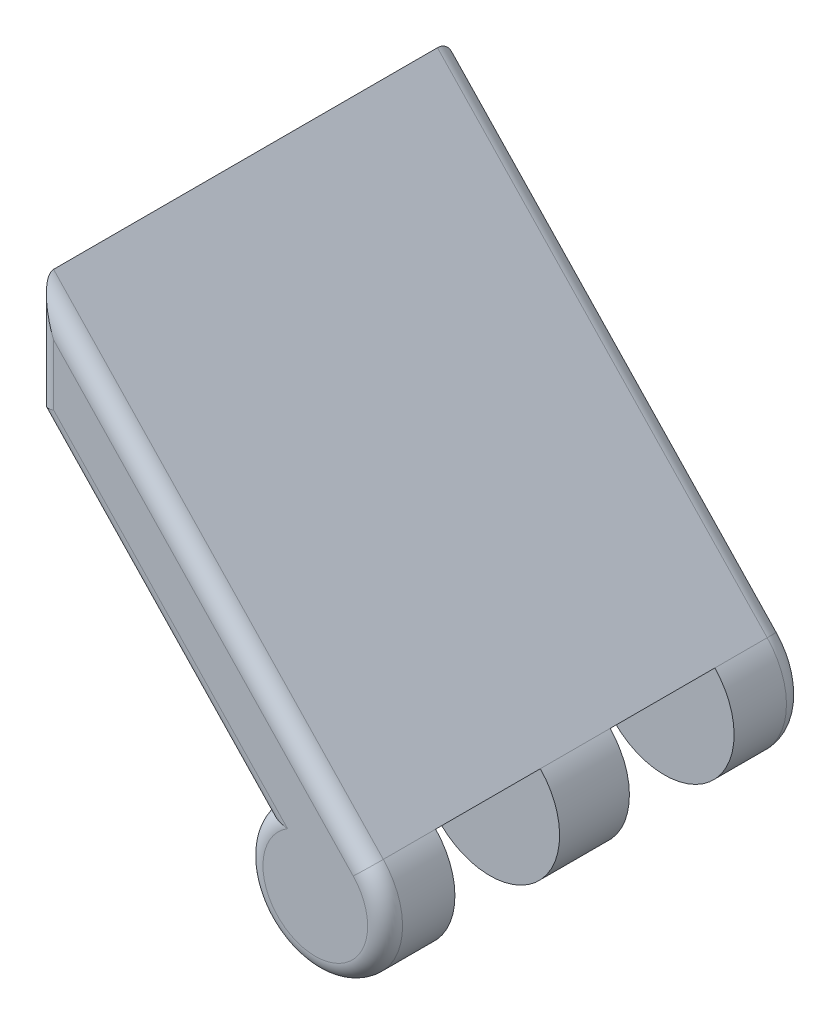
ISO-10303-21;
HEADER;
FILE_DESCRIPTION(('STEP AP214'),'2;1');
FILE_NAME('part.step','',(''),(''),'','','');
FILE_SCHEMA(('AUTOMOTIVE_DESIGN { 1 0 10303 214 1 1 1 1 }'));
ENDSEC;
DATA;
#1=APPLICATION_CONTEXT('core data for automotive mechanical design processes');
#2=APPLICATION_PROTOCOL_DEFINITION('international standard','automotive_design',2000,#1);
#3=PRODUCT_CONTEXT('',#1,'mechanical');
#4=PRODUCT('Part','Part','',(#3));
#5=PRODUCT_RELATED_PRODUCT_CATEGORY('part','',(#4));
#6=PRODUCT_DEFINITION_FORMATION('','',#4);
#7=PRODUCT_DEFINITION_CONTEXT('part definition',#1,'design');
#8=PRODUCT_DEFINITION('design','',#6,#7);
#9=PRODUCT_DEFINITION_SHAPE('','',#8);
#10=(LENGTH_UNIT() NAMED_UNIT(*) SI_UNIT(.MILLI.,.METRE.));
#11=(NAMED_UNIT(*) PLANE_ANGLE_UNIT() SI_UNIT($,.RADIAN.));
#12=(NAMED_UNIT(*) SI_UNIT($,.STERADIAN.) SOLID_ANGLE_UNIT());
#13=UNCERTAINTY_MEASURE_WITH_UNIT(LENGTH_MEASURE(1.E-05),#10,'distance_accuracy_value','');
#14=(GEOMETRIC_REPRESENTATION_CONTEXT(3) GLOBAL_UNCERTAINTY_ASSIGNED_CONTEXT((#13)) GLOBAL_UNIT_ASSIGNED_CONTEXT((#10,
#11,#12)) REPRESENTATION_CONTEXT('',''));
#15=CARTESIAN_POINT('',(0.,0.,0.));
#16=DIRECTION('',(0.,0.,1.));
#17=DIRECTION('',(1.,0.,0.));
#18=AXIS2_PLACEMENT_3D('',#15,#16,#17);
#19=CARTESIAN_POINT('',(98.5993510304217,230.596126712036,15.24));
#20=DIRECTION('',(0.,0.,-1.));
#21=DIRECTION('',(-1.,0.,0.));
#22=AXIS2_PLACEMENT_3D('',#19,#20,#21);
#23=CYLINDRICAL_SURFACE('',#22,5.08);
#24=CARTESIAN_POINT('',(98.5993510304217,230.596126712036,-10.16));
#25=DIRECTION('',(0.,0.,1.));
#26=DIRECTION('',(1.,0.,0.));
#27=AXIS2_PLACEMENT_3D('',#24,#25,#26);
#28=CIRCLE('',#27,5.07999999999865);
#29=CARTESIAN_POINT('',(94.74509960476,233.905378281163,-10.16));
#30=VERTEX_POINT('',#29);
#31=CARTESIAN_POINT('',(102.277439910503,234.10013330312,-10.16));
#32=VERTEX_POINT('',#31);
#33=EDGE_CURVE('E131',#30,#32,#28,.T.);
#34=ORIENTED_EDGE('',*,*,#33,.F.);
#35=DIRECTION('',(0.,0.,-1.));
#36=VECTOR('',#35,1.);
#37=CARTESIAN_POINT('',(94.7450996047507,233.905378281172,15.24));
#38=LINE('',#37,#36);
#39=CARTESIAN_POINT('',(94.7450996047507,233.905378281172,-13.97));
#40=VERTEX_POINT('',#39);
#41=EDGE_CURVE('E151',#30,#40,#38,.T.);
#42=ORIENTED_EDGE('',*,*,#41,.T.);
#43=CARTESIAN_POINT('',(98.5993510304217,230.596126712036,-13.97));
#44=DIRECTION('',(0.,0.,1.));
#45=DIRECTION('',(1.,0.,0.));
#46=AXIS2_PLACEMENT_3D('',#43,#44,#45);
#47=CIRCLE('',#46,5.08);
#48=CARTESIAN_POINT('',(102.277439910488,234.100133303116,-13.97));
#49=VERTEX_POINT('',#48);
#50=EDGE_CURVE('E157',#40,#49,#47,.T.);
#51=ORIENTED_EDGE('',*,*,#50,.T.);
#52=DIRECTION('',(0.,0.,-1.));
#53=VECTOR('',#52,1.);
#54=CARTESIAN_POINT('',(102.277439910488,234.100133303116,15.24));
#55=LINE('',#54,#53);
#56=EDGE_CURVE('E145',#32,#49,#55,.T.);
#57=ORIENTED_EDGE('',*,*,#56,.F.);
#58=EDGE_LOOP('',(#34,#42,#51,#57));
#59=FACE_BOUND('',#58,.T.);
#60=ADVANCED_FACE('F30',(#59),#23,.T.);
#61=CARTESIAN_POINT('',(94.7450996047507,233.905378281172,2.54));
#62=VERTEX_POINT('',#61);
#63=CARTESIAN_POINT('',(94.7450996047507,233.905378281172,-2.53999999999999));
#64=VERTEX_POINT('',#63);
#65=EDGE_CURVE('E141',#62,#64,#38,.T.);
#66=ORIENTED_EDGE('',*,*,#65,.T.);
#67=CARTESIAN_POINT('',(98.5993510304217,230.596126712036,-2.54));
#68=DIRECTION('',(0.,0.,1.));
#69=DIRECTION('',(1.,0.,0.));
#70=AXIS2_PLACEMENT_3D('',#67,#68,#69);
#71=CIRCLE('',#70,5.07999999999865);
#72=CARTESIAN_POINT('',(102.277439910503,234.10013330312,-2.54));
#73=VERTEX_POINT('',#72);
#74=EDGE_CURVE('E129',#64,#73,#71,.T.);
#75=ORIENTED_EDGE('',*,*,#74,.T.);
#76=CARTESIAN_POINT('',(102.277439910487,234.100133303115,2.54));
#77=VERTEX_POINT('',#76);
#78=EDGE_CURVE('E138',#77,#73,#55,.T.);
#79=ORIENTED_EDGE('',*,*,#78,.F.);
#80=CARTESIAN_POINT('',(98.5993510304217,230.596126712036,2.54));
#81=DIRECTION('',(0.,0.,1.));
#82=DIRECTION('',(1.,0.,0.));
#83=AXIS2_PLACEMENT_3D('',#80,#81,#82);
#84=CIRCLE('',#83,5.08);
#85=EDGE_CURVE('E38',#62,#77,#84,.T.);
#86=ORIENTED_EDGE('',*,*,#85,.F.);
#87=EDGE_LOOP('',(#66,#75,#79,#86));
#88=FACE_BOUND('',#87,.T.);
#89=ADVANCED_FACE('F136',(#88),#23,.T.);
#90=CARTESIAN_POINT('',(-44592.4615174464,47149.3150691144,15.24));
#91=DIRECTION('',(0.724033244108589,0.689765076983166,0.));
#92=DIRECTION('',(-0.689765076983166,0.724033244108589,0.));
#93=AXIS2_PLACEMENT_3D('',#90,#91,#92);
#94=PLANE('',#93);
#95=CARTESIAN_POINT('',(102.277439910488,234.100133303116,13.97));
#96=VERTEX_POINT('',#95);
#97=CARTESIAN_POINT('',(102.277439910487,234.100133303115,10.16));
#98=VERTEX_POINT('',#97);
#99=EDGE_CURVE('E147',#96,#98,#55,.T.);
#100=ORIENTED_EDGE('',*,*,#99,.T.);
#101=EDGE_CURVE('E144',#98,#77,#55,.T.);
#102=ORIENTED_EDGE('',*,*,#101,.T.);
#103=ORIENTED_EDGE('',*,*,#78,.T.);
#104=DIRECTION('',(0.,0.,1.));
#105=VECTOR('',#104,1.);
#106=CARTESIAN_POINT('',(102.277439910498,234.100133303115,-10.16));
#107=LINE('',#106,#105);
#108=EDGE_CURVE('E118',#32,#73,#107,.T.);
#109=ORIENTED_EDGE('',*,*,#108,.F.);
#110=ORIENTED_EDGE('',*,*,#56,.T.);
#111=DIRECTION('',(0.689765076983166,-0.724033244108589,0.));
#112=VECTOR('',#111,1.);
#113=CARTESIAN_POINT('',(78.2793510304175,259.290469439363,-13.97));
#114=LINE('',#113,#112);
#115=CARTESIAN_POINT('',(78.2793510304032,259.29046943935,-13.97));
#116=VERTEX_POINT('',#115);
#117=EDGE_CURVE('E189',#49,#116,#114,.F.);
#118=ORIENTED_EDGE('',*,*,#117,.T.);
#119=DIRECTION('',(0.,0.,-1.));
#120=VECTOR('',#119,1.);
#121=CARTESIAN_POINT('',(78.2793510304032,259.29046943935,15.24));
#122=LINE('',#121,#120);
#123=CARTESIAN_POINT('',(78.2793510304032,259.29046943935,13.97));
#124=VERTEX_POINT('',#123);
#125=EDGE_CURVE('E158',#124,#116,#122,.T.);
#126=ORIENTED_EDGE('',*,*,#125,.F.);
#127=DIRECTION('',(0.689765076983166,-0.724033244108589,0.));
#128=VECTOR('',#127,1.);
#129=CARTESIAN_POINT('',(-44592.4615174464,47149.3150691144,13.97));
#130=LINE('',#129,#128);
#131=EDGE_CURVE('E187',#124,#96,#130,.T.);
#132=ORIENTED_EDGE('',*,*,#131,.T.);
#133=EDGE_LOOP('',(#100,#102,#103,#109,#110,#118,#126,#132));
#134=FACE_BOUND('',#133,.T.);
#135=ADVANCED_FACE('F143',(#134),#94,.T.);
#136=CARTESIAN_POINT('',(78.2793510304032,-291350.271458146,15.24));
#137=DIRECTION('',(-1.,0.,0.));
#138=DIRECTION('',(0.,0.,1.));
#139=AXIS2_PLACEMENT_3D('',#136,#137,#138);
#140=PLANE('',#139);
#141=DIRECTION('',(0.,1.,0.));
#142=VECTOR('',#141,1.);
#143=CARTESIAN_POINT('',(78.2793510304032,-291350.271458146,-15.24));
#144=LINE('',#143,#142);
#145=CARTESIAN_POINT('',(78.2793510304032,253.030367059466,-15.24));
#146=VERTEX_POINT('',#145);
#147=CARTESIAN_POINT('',(78.2793510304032,257.449262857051,-15.24));
#148=VERTEX_POINT('',#147);
#149=EDGE_CURVE('E148',#146,#148,#144,.T.);
#150=ORIENTED_EDGE('',*,*,#149,.F.);
#151=CARTESIAN_POINT('',(78.2793510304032,253.030367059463,-13.97));
#152=DIRECTION('',(-1.,0.,0.));
#153=DIRECTION('',(0.,-1.,0.));
#154=AXIS2_PLACEMENT_3D('',#151,#152,#153);
#155=ELLIPSE('',#154,1.841206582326,1.27);
#156=CARTESIAN_POINT('',(78.2793510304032,251.189160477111,-13.97));
#157=VERTEX_POINT('',#156);
#158=EDGE_CURVE('E180',#146,#157,#155,.T.);
#159=ORIENTED_EDGE('',*,*,#158,.T.);
#160=DIRECTION('',(0.,0.,-1.));
#161=VECTOR('',#160,1.);
#162=CARTESIAN_POINT('',(78.2793510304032,251.189160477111,15.24));
#163=LINE('',#162,#161);
#164=CARTESIAN_POINT('',(78.2793510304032,251.189160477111,13.97));
#165=VERTEX_POINT('',#164);
#166=EDGE_CURVE('E248',#165,#157,#163,.T.);
#167=ORIENTED_EDGE('',*,*,#166,.F.);
#168=DIRECTION('',(0.,1.,0.));
#169=VECTOR('',#168,1.);
#170=CARTESIAN_POINT('',(78.2793510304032,-291350.271458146,13.97));
#171=LINE('',#170,#169);
#172=EDGE_CURVE('E176',#165,#124,#171,.T.);
#173=ORIENTED_EDGE('',*,*,#172,.T.);
#174=ORIENTED_EDGE('',*,*,#125,.T.);
#175=CARTESIAN_POINT('',(78.2793510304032,257.449262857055,-13.97));
#176=DIRECTION('',(-1.,0.,0.));
#177=DIRECTION('',(0.,1.,0.));
#178=AXIS2_PLACEMENT_3D('',#175,#176,#177);
#179=ELLIPSE('',#178,1.84120658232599,1.27);
#180=EDGE_CURVE('E178',#116,#148,#179,.T.);
#181=ORIENTED_EDGE('',*,*,#180,.T.);
#182=EDGE_LOOP('',(#150,#159,#167,#173,#174,#181));
#183=FACE_BOUND('',#182,.T.);
#184=ADVANCED_FACE('F278',(#183),#140,.T.);
#185=CARTESIAN_POINT('',(-44596.5074152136,47145.4606618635,15.24));
#186=DIRECTION('',(-0.724033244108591,-0.689765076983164,0.));
#187=DIRECTION('',(0.689765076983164,-0.724033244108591,0.));
#188=AXIS2_PLACEMENT_3D('',#185,#186,#187);
#189=PLANE('',#188);
#190=ORIENTED_EDGE('',*,*,#166,.T.);
#191=DIRECTION('',(-0.689765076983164,0.724033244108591,0.));
#192=VECTOR('',#191,1.);
#193=CARTESIAN_POINT('',(94.7450996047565,233.905378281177,-13.97));
#194=LINE('',#193,#192);
#195=EDGE_CURVE('E184',#157,#40,#194,.F.);
#196=ORIENTED_EDGE('',*,*,#195,.T.);
#197=ORIENTED_EDGE('',*,*,#41,.F.);
#198=EDGE_CURVE('E256',#64,#30,#38,.T.);
#199=ORIENTED_EDGE('',*,*,#198,.F.);
#200=ORIENTED_EDGE('',*,*,#65,.F.);
#201=CARTESIAN_POINT('',(94.7450996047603,233.905378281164,10.16));
#202=VERTEX_POINT('',#201);
#203=EDGE_CURVE('E240',#202,#62,#38,.T.);
#204=ORIENTED_EDGE('',*,*,#203,.F.);
#205=CARTESIAN_POINT('',(94.7450996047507,233.905378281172,13.97));
#206=VERTEX_POINT('',#205);
#207=EDGE_CURVE('E152',#206,#202,#38,.T.);
#208=ORIENTED_EDGE('',*,*,#207,.F.);
#209=DIRECTION('',(-0.689765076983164,0.724033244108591,0.));
#210=VECTOR('',#209,1.);
#211=CARTESIAN_POINT('',(-44596.5074152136,47145.4606618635,13.97));
#212=LINE('',#211,#210);
#213=EDGE_CURVE('E182',#206,#165,#212,.T.);
#214=ORIENTED_EDGE('',*,*,#213,.T.);
#215=EDGE_LOOP('',(#190,#196,#197,#199,#200,#204,#208,#214));
#216=FACE_BOUND('',#215,.T.);
#217=ADVANCED_FACE('F263',(#216),#189,.T.);
#218=ORIENTED_EDGE('',*,*,#207,.T.);
#219=CARTESIAN_POINT('',(98.5993510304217,230.596126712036,10.16));
#220=DIRECTION('',(0.,0.,1.));
#221=DIRECTION('',(1.,0.,0.));
#222=AXIS2_PLACEMENT_3D('',#219,#220,#221);
#223=CIRCLE('',#222,5.08);
#224=EDGE_CURVE('E11',#202,#98,#223,.T.);
#225=ORIENTED_EDGE('',*,*,#224,.T.);
#226=ORIENTED_EDGE('',*,*,#99,.F.);
#227=CARTESIAN_POINT('',(98.5993510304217,230.596126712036,13.97));
#228=DIRECTION('',(0.,0.,1.));
#229=DIRECTION('',(1.,0.,0.));
#230=AXIS2_PLACEMENT_3D('',#227,#228,#229);
#231=CIRCLE('',#230,5.08);
#232=EDGE_CURVE('E154',#96,#206,#231,.F.);
#233=ORIENTED_EDGE('',*,*,#232,.T.);
#234=EDGE_LOOP('',(#218,#225,#226,#233));
#235=FACE_BOUND('',#234,.T.);
#236=ADVANCED_FACE('F296',(#235),#23,.T.);
#237=CARTESIAN_POINT('',(98.5993510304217,230.596126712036,15.24));
#238=DIRECTION('',(0.,0.,1.));
#239=DIRECTION('',(1.,0.,0.));
#240=AXIS2_PLACEMENT_3D('',#237,#238,#239);
#241=PLANE('',#240);
#242=DIRECTION('',(-0.689765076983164,0.724033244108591,0.));
#243=VECTOR('',#242,1.);
#244=CARTESIAN_POINT('',(99.1510643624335,231.121727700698,15.24));
#245=LINE('',#244,#243);
#246=CARTESIAN_POINT('',(79.5493510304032,251.697272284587,15.24));
#247=VERTEX_POINT('',#246);
#248=CARTESIAN_POINT('',(96.5761559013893,233.824559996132,15.24));
#249=VERTEX_POINT('',#248);
#250=EDGE_CURVE('E171',#247,#249,#245,.F.);
#251=ORIENTED_EDGE('',*,*,#250,.T.);
#252=CARTESIAN_POINT('',(98.5993510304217,230.596126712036,15.24));
#253=DIRECTION('',(0.,0.,1.));
#254=DIRECTION('',(1.,0.,0.));
#255=AXIS2_PLACEMENT_3D('',#252,#253,#254);
#256=CIRCLE('',#255,3.81);
#257=CARTESIAN_POINT('',(101.357917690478,233.224131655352,15.24));
#258=VERTEX_POINT('',#257);
#259=EDGE_CURVE('E173',#249,#258,#256,.T.);
#260=ORIENTED_EDGE('',*,*,#259,.T.);
#261=DIRECTION('',(0.689765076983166,-0.724033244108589,0.));
#262=VECTOR('',#261,1.);
#263=CARTESIAN_POINT('',(101.357917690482,233.224131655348,15.24));
#264=LINE('',#263,#262);
#265=CARTESIAN_POINT('',(79.5493510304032,256.11616808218,15.24));
#266=VERTEX_POINT('',#265);
#267=EDGE_CURVE('E169',#258,#266,#264,.F.);
#268=ORIENTED_EDGE('',*,*,#267,.T.);
#269=DIRECTION('',(0.,1.,0.));
#270=VECTOR('',#269,1.);
#271=CARTESIAN_POINT('',(79.5493510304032,230.596126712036,15.24));
#272=LINE('',#271,#270);
#273=EDGE_CURVE('E167',#266,#247,#272,.F.);
#274=ORIENTED_EDGE('',*,*,#273,.T.);
#275=EDGE_LOOP('',(#251,#260,#268,#274));
#276=FACE_BOUND('',#275,.T.);
#277=ADVANCED_FACE('F290',(#276),#241,.T.);
#278=CARTESIAN_POINT('',(98.5993510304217,230.596126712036,-15.24));
#279=DIRECTION('',(0.,0.,1.));
#280=DIRECTION('',(1.,0.,0.));
#281=AXIS2_PLACEMENT_3D('',#278,#279,#280);
#282=PLANE('',#281);
#283=CARTESIAN_POINT('',(98.5993510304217,230.596126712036,-15.24));
#284=DIRECTION('',(0.,0.,1.));
#285=DIRECTION('',(1.,0.,0.));
#286=AXIS2_PLACEMENT_3D('',#283,#284,#285);
#287=CIRCLE('',#286,3.81);
#288=CARTESIAN_POINT('',(101.357917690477,233.224131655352,-15.24));
#289=VERTEX_POINT('',#288);
#290=CARTESIAN_POINT('',(96.5761559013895,233.824559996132,-15.24));
#291=VERTEX_POINT('',#290);
#292=EDGE_CURVE('E163',#289,#291,#287,.F.);
#293=ORIENTED_EDGE('',*,*,#292,.T.);
#294=DIRECTION('',(-0.689765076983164,0.724033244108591,0.));
#295=VECTOR('',#294,1.);
#296=CARTESIAN_POINT('',(79.1988732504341,252.065162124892,-15.24));
#297=LINE('',#296,#295);
#298=EDGE_CURVE('E165',#291,#146,#297,.T.);
#299=ORIENTED_EDGE('',*,*,#298,.T.);
#300=ORIENTED_EDGE('',*,*,#149,.T.);
#301=DIRECTION('',(0.689765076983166,-0.724033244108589,0.));
#302=VECTOR('',#301,1.);
#303=CARTESIAN_POINT('',(101.357917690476,233.224131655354,-15.24));
#304=LINE('',#303,#302);
#305=EDGE_CURVE('E161',#148,#289,#304,.T.);
#306=ORIENTED_EDGE('',*,*,#305,.T.);
#307=EDGE_LOOP('',(#293,#299,#300,#306));
#308=FACE_BOUND('',#307,.T.);
#309=ADVANCED_FACE('F319',(#308),#282,.F.);
#310=CARTESIAN_POINT('',(99.1510643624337,231.121727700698,-13.97));
#311=DIRECTION('',(0.689765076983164,-0.724033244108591,0.));
#312=DIRECTION('',(0.724033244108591,0.689765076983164,0.));
#313=AXIS2_PLACEMENT_3D('',#310,#311,#312);
#314=CYLINDRICAL_SURFACE('',#313,1.27);
#315=ORIENTED_EDGE('',*,*,#158,.F.);
#316=ORIENTED_EDGE('',*,*,#298,.F.);
#317=CARTESIAN_POINT('',(94.7450996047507,233.905378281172,-13.97));
#318=CARTESIAN_POINT('',(94.7450957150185,233.905377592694,-13.9990121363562));
#319=CARTESIAN_POINT('',(94.7464407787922,233.905413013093,-14.0280075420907));
#320=CARTESIAN_POINT('',(94.7517787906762,233.905549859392,-14.0857368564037));
#321=CARTESIAN_POINT('',(94.7557701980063,233.905651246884,-14.1144709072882));
#322=CARTESIAN_POINT('',(94.7715583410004,233.906043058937,-14.1995427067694));
#323=CARTESIAN_POINT('',(94.7871708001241,233.906421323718,-14.2552117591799));
#324=CARTESIAN_POINT('',(94.8275466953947,233.907297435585,-14.3629241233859));
#325=CARTESIAN_POINT('',(94.8522925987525,233.907795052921,-14.4149741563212));
#326=CARTESIAN_POINT('',(94.9096036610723,233.908754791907,-14.514641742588));
#327=CARTESIAN_POINT('',(94.9421824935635,233.909216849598,-14.562251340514));
#328=CARTESIAN_POINT('',(95.0256896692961,233.910057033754,-14.6674616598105));
#329=CARTESIAN_POINT('',(95.0791114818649,233.910355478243,-14.7230825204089));
#330=CARTESIAN_POINT('',(95.1942423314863,233.910222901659,-14.8249212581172));
#331=CARTESIAN_POINT('',(95.2559646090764,233.90979070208,-14.8711238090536));
#332=CARTESIAN_POINT('',(95.408671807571,233.9075442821,-14.9695185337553));
#333=CARTESIAN_POINT('',(95.502154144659,233.905285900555,-15.0178113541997));
#334=CARTESIAN_POINT('',(95.695428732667,233.898273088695,-15.0990537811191));
#335=CARTESIAN_POINT('',(95.7952308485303,233.893514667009,-15.1319786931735));
#336=CARTESIAN_POINT('',(96.0066364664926,233.880591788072,-15.1864173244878));
#337=CARTESIAN_POINT('',(96.1185254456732,233.872173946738,-15.2067346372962));
#338=CARTESIAN_POINT('',(96.3433990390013,233.851631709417,-15.233382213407));
#339=CARTESIAN_POINT('',(96.456381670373,233.839513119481,-15.2397342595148));
#340=CARTESIAN_POINT('',(96.5713928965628,233.825157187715,-15.2399972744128));
#341=CARTESIAN_POINT('',(96.5737744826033,233.824859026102,-15.2399999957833));
#342=CARTESIAN_POINT('',(96.5761559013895,233.824559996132,-15.24));
#343=B_SPLINE_CURVE_WITH_KNOTS('',3,(#317,#318,#319,#320,#321,#322,#323,#324,#325,#326,#327,
#328,#329,#330,#331,#332,#333,#334,#335,#336,#337,#338,#339,#340,#341,#342),.UNSPECIFIED.,.F.,
.F.,(4,2,2,2,2,2,2,2,2,2,2,2,4),(0.,0.0869731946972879,0.17389579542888,0.346376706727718,
0.518528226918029,0.690982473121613,0.921081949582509,1.15155292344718,1.46556365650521,
1.78007724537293,2.1211129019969,2.46161623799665,2.46881676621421),.UNSPECIFIED.);
#344=EDGE_CURVE('E194',#40,#291,#343,.T.);
#345=ORIENTED_EDGE('',*,*,#344,.F.);
#346=ORIENTED_EDGE('',*,*,#195,.F.);
#347=EDGE_LOOP('',(#315,#316,#345,#346));
#348=FACE_BOUND('',#347,.T.);
#349=ADVANCED_FACE('F205',(#348),#314,.T.);
#350=CARTESIAN_POINT('',(101.357917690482,233.224131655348,-13.97));
#351=DIRECTION('',(-0.689765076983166,0.724033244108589,0.));
#352=DIRECTION('',(-0.724033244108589,-0.689765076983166,0.));
#353=AXIS2_PLACEMENT_3D('',#350,#351,#352);
#354=CYLINDRICAL_SURFACE('',#353,1.27);
#355=ORIENTED_EDGE('',*,*,#180,.F.);
#356=ORIENTED_EDGE('',*,*,#117,.F.);
#357=CARTESIAN_POINT('',(101.357917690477,233.224131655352,-13.97));
#358=DIRECTION('',(0.689765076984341,-0.72403324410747,0.));
#359=DIRECTION('',(0.72403324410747,0.689765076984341,0.));
#360=AXIS2_PLACEMENT_3D('',#357,#358,#359);
#361=CIRCLE('',#360,1.27);
#362=EDGE_CURVE('E191',#289,#49,#361,.T.);
#363=ORIENTED_EDGE('',*,*,#362,.F.);
#364=ORIENTED_EDGE('',*,*,#305,.F.);
#365=EDGE_LOOP('',(#355,#356,#363,#364));
#366=FACE_BOUND('',#365,.T.);
#367=ADVANCED_FACE('F212',(#366),#354,.T.);
#368=CARTESIAN_POINT('',(98.5993510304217,230.596126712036,-13.97));
#369=DIRECTION('',(0.,0.,1.));
#370=DIRECTION('',(1.,0.,0.));
#371=AXIS2_PLACEMENT_3D('',#368,#369,#370);
#372=TOROIDAL_SURFACE('',#371,3.81,1.27);
#373=ORIENTED_EDGE('',*,*,#344,.T.);
#374=ORIENTED_EDGE('',*,*,#292,.F.);
#375=ORIENTED_EDGE('',*,*,#362,.T.);
#376=ORIENTED_EDGE('',*,*,#50,.F.);
#377=EDGE_LOOP('',(#373,#374,#375,#376));
#378=FACE_BOUND('',#377,.T.);
#379=ADVANCED_FACE('F208',(#378),#372,.T.);
#380=CARTESIAN_POINT('',(79.5493510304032,-291350.271458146,13.97));
#381=DIRECTION('',(0.,1.,0.));
#382=DIRECTION('',(0.,0.,1.));
#383=AXIS2_PLACEMENT_3D('',#380,#381,#382);
#384=CYLINDRICAL_SURFACE('',#383,1.27);
#385=CARTESIAN_POINT('',(79.5493510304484,256.116168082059,13.97));
#386=DIRECTION('',(0.928448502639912,0.371461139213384,0.));
#387=DIRECTION('',(-0.371461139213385,0.928448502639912,0.));
#388=AXIS2_PLACEMENT_3D('',#385,#386,#387);
#389=ELLIPSE('',#388,3.41893098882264,1.27);
#390=EDGE_CURVE('E231',#124,#266,#389,.T.);
#391=ORIENTED_EDGE('',*,*,#390,.F.);
#392=ORIENTED_EDGE('',*,*,#172,.F.);
#393=CARTESIAN_POINT('',(79.5493510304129,251.697272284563,13.97));
#394=DIRECTION('',(-0.371461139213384,0.928448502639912,0.));
#395=DIRECTION('',(0.928448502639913,0.371461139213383,0.));
#396=AXIS2_PLACEMENT_3D('',#393,#394,#395);
#397=ELLIPSE('',#396,1.36787338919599,1.27);
#398=EDGE_CURVE('E195',#247,#165,#397,.F.);
#399=ORIENTED_EDGE('',*,*,#398,.F.);
#400=ORIENTED_EDGE('',*,*,#273,.F.);
#401=EDGE_LOOP('',(#391,#392,#399,#400));
#402=FACE_BOUND('',#401,.T.);
#403=ADVANCED_FACE('F32',(#402),#384,.T.);
#404=CARTESIAN_POINT('',(-44595.5878929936,47146.3366635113,13.97));
#405=DIRECTION('',(-0.689765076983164,0.724033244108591,0.));
#406=DIRECTION('',(-0.724033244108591,-0.689765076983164,0.));
#407=AXIS2_PLACEMENT_3D('',#404,#405,#406);
#408=CYLINDRICAL_SURFACE('',#407,1.27);
#409=ORIENTED_EDGE('',*,*,#398,.T.);
#410=ORIENTED_EDGE('',*,*,#213,.F.);
#411=CARTESIAN_POINT('',(94.7450996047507,233.905378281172,13.97));
#412=CARTESIAN_POINT('',(94.745095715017,233.905377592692,13.9990121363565));
#413=CARTESIAN_POINT('',(94.7464407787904,233.90541301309,14.0280075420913));
#414=CARTESIAN_POINT('',(94.7517787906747,233.90554985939,14.0857368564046));
#415=CARTESIAN_POINT('',(94.7557701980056,233.905651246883,14.1144709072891));
#416=CARTESIAN_POINT('',(94.7715583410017,233.906043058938,14.1995427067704));
#417=CARTESIAN_POINT('',(94.7871708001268,233.906421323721,14.2552117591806));
#418=CARTESIAN_POINT('',(94.8275466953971,233.907297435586,14.3629241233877));
#419=CARTESIAN_POINT('',(94.8522925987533,233.907795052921,14.4149741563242));
#420=CARTESIAN_POINT('',(94.9096036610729,233.908754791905,14.5146417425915));
#421=CARTESIAN_POINT('',(94.9421824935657,233.909216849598,14.5622513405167));
#422=CARTESIAN_POINT('',(95.0256896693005,233.910057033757,14.6674616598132));
#423=CARTESIAN_POINT('',(95.0791114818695,233.910355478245,14.7230825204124));
#424=CARTESIAN_POINT('',(95.194242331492,233.910222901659,14.8249212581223));
#425=CARTESIAN_POINT('',(95.2559646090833,233.909790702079,14.8711238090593));
#426=CARTESIAN_POINT('',(95.4086718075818,233.9075442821,14.9695185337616));
#427=CARTESIAN_POINT('',(95.5021541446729,233.905285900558,15.0178113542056));
#428=CARTESIAN_POINT('',(95.6954287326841,233.898273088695,15.0990537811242));
#429=CARTESIAN_POINT('',(95.7952308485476,233.893514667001,15.1319786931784));
#430=CARTESIAN_POINT('',(96.006636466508,233.880591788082,15.1864173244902));
#431=CARTESIAN_POINT('',(96.1185254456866,233.872173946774,15.2067346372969));
#432=CARTESIAN_POINT('',(96.3433990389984,233.851631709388,15.2333822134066));
#433=CARTESIAN_POINT('',(96.4563816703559,233.839513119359,15.2397342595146));
#434=CARTESIAN_POINT('',(96.5713928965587,233.82515718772,15.2399972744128));
#435=CARTESIAN_POINT('',(96.5737744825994,233.82485902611,15.2399999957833));
#436=CARTESIAN_POINT('',(96.576155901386,233.824559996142,15.24));
#437=B_SPLINE_CURVE_WITH_KNOTS('',3,(#411,#412,#413,#414,#415,#416,#417,#418,#419,#420,#421,
#422,#423,#424,#425,#426,#427,#428,#429,#430,#431,#432,#433,#434,#435,#436),.UNSPECIFIED.,.F.,
.F.,(4,2,2,2,2,2,2,2,2,2,2,2,4),(0.,0.0869731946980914,0.173895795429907,0.346376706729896,
0.518528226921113,0.690982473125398,0.921081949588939,1.15155292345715,1.46556365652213,
1.78007724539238,2.12111290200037,2.46161623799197,2.46881676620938),.UNSPECIFIED.);
#438=EDGE_CURVE('E226',#249,#206,#437,.F.);
#439=ORIENTED_EDGE('',*,*,#438,.F.);
#440=ORIENTED_EDGE('',*,*,#250,.F.);
#441=EDGE_LOOP('',(#409,#410,#439,#440));
#442=FACE_BOUND('',#441,.T.);
#443=ADVANCED_FACE('F224',(#442),#408,.T.);
#444=CARTESIAN_POINT('',(-44593.3810396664,47148.4390674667,13.97));
#445=DIRECTION('',(0.689765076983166,-0.724033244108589,0.));
#446=DIRECTION('',(0.724033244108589,0.689765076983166,0.));
#447=AXIS2_PLACEMENT_3D('',#444,#445,#446);
#448=CYLINDRICAL_SURFACE('',#447,1.27);
#449=ORIENTED_EDGE('',*,*,#390,.T.);
#450=ORIENTED_EDGE('',*,*,#267,.F.);
#451=CARTESIAN_POINT('',(101.357917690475,233.224131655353,13.97));
#452=DIRECTION('',(0.689765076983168,-0.724033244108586,-1.61443908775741E-12));
#453=DIRECTION('',(0.724033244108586,0.689765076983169,0.));
#454=AXIS2_PLACEMENT_3D('',#451,#452,#453);
#455=CIRCLE('',#454,1.27);
#456=EDGE_CURVE('E203',#96,#258,#455,.T.);
#457=ORIENTED_EDGE('',*,*,#456,.F.);
#458=ORIENTED_EDGE('',*,*,#131,.F.);
#459=EDGE_LOOP('',(#449,#450,#457,#458));
#460=FACE_BOUND('',#459,.T.);
#461=ADVANCED_FACE('F222',(#460),#448,.T.);
#462=CARTESIAN_POINT('',(98.5993510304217,230.596126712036,13.97));
#463=DIRECTION('',(0.,0.,1.));
#464=DIRECTION('',(1.,0.,0.));
#465=AXIS2_PLACEMENT_3D('',#462,#463,#464);
#466=TOROIDAL_SURFACE('',#465,3.81,1.27);
#467=ORIENTED_EDGE('',*,*,#438,.T.);
#468=ORIENTED_EDGE('',*,*,#232,.F.);
#469=ORIENTED_EDGE('',*,*,#456,.T.);
#470=ORIENTED_EDGE('',*,*,#259,.F.);
#471=EDGE_LOOP('',(#467,#468,#469,#470));
#472=FACE_BOUND('',#471,.T.);
#473=ADVANCED_FACE('F217',(#472),#466,.T.);
#474=CARTESIAN_POINT('',(98.5993510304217,230.596126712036,10.16));
#475=DIRECTION('',(0.,0.,-1.));
#476=DIRECTION('',(-1.,0.,0.));
#477=AXIS2_PLACEMENT_3D('',#474,#475,#476);
#478=CYLINDRICAL_SURFACE('',#477,5.07999999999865);
#479=ORIENTED_EDGE('',*,*,#101,.F.);
#480=CARTESIAN_POINT('',(98.5993510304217,230.596126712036,10.16));
#481=DIRECTION('',(0.,0.,1.));
#482=DIRECTION('',(1.,0.,0.));
#483=AXIS2_PLACEMENT_3D('',#480,#481,#482);
#484=CIRCLE('',#483,5.07999999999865);
#485=EDGE_CURVE('E241',#98,#202,#484,.T.);
#486=ORIENTED_EDGE('',*,*,#485,.T.);
#487=ORIENTED_EDGE('',*,*,#203,.T.);
#488=CARTESIAN_POINT('',(98.5993510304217,230.596126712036,2.54));
#489=DIRECTION('',(0.,0.,1.));
#490=DIRECTION('',(1.,0.,0.));
#491=AXIS2_PLACEMENT_3D('',#488,#489,#490);
#492=CIRCLE('',#491,5.07999999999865);
#493=EDGE_CURVE('E52',#77,#62,#492,.T.);
#494=ORIENTED_EDGE('',*,*,#493,.F.);
#495=EDGE_LOOP('',(#479,#486,#487,#494));
#496=FACE_BOUND('',#495,.T.);
#497=ADVANCED_FACE('F221',(#496),#478,.F.);
#498=CARTESIAN_POINT('',(98.5993510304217,230.596126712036,10.16));
#499=DIRECTION('',(0.,0.,1.));
#500=DIRECTION('',(1.,0.,0.));
#501=AXIS2_PLACEMENT_3D('',#498,#499,#500);
#502=PLANE('',#501);
#503=ORIENTED_EDGE('',*,*,#485,.F.);
#504=ORIENTED_EDGE('',*,*,#224,.F.);
#505=EDGE_LOOP('',(#503,#504));
#506=FACE_BOUND('',#505,.T.);
#507=ADVANCED_FACE('F298',(#506),#502,.F.);
#508=CARTESIAN_POINT('',(98.5993510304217,230.596126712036,2.54));
#509=DIRECTION('',(0.,0.,1.));
#510=DIRECTION('',(1.,0.,0.));
#511=AXIS2_PLACEMENT_3D('',#508,#509,#510);
#512=PLANE('',#511);
#513=ORIENTED_EDGE('',*,*,#493,.T.);
#514=ORIENTED_EDGE('',*,*,#85,.T.);
#515=EDGE_LOOP('',(#513,#514));
#516=FACE_BOUND('',#515,.T.);
#517=ADVANCED_FACE('F235',(#516),#512,.T.);
#518=CARTESIAN_POINT('',(98.5993510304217,230.596126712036,-10.16));
#519=DIRECTION('',(0.,0.,1.));
#520=DIRECTION('',(1.,0.,0.));
#521=AXIS2_PLACEMENT_3D('',#518,#519,#520);
#522=CYLINDRICAL_SURFACE('',#521,5.07999999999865);
#523=ORIENTED_EDGE('',*,*,#108,.T.);
#524=EDGE_CURVE('E45',#73,#64,#71,.T.);
#525=ORIENTED_EDGE('',*,*,#524,.T.);
#526=ORIENTED_EDGE('',*,*,#198,.T.);
#527=EDGE_CURVE('E121',#32,#30,#28,.T.);
#528=ORIENTED_EDGE('',*,*,#527,.F.);
#529=EDGE_LOOP('',(#523,#525,#526,#528));
#530=FACE_BOUND('',#529,.T.);
#531=ADVANCED_FACE('F119',(#530),#522,.F.);
#532=CARTESIAN_POINT('',(98.5993510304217,230.596126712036,-10.16));
#533=DIRECTION('',(0.,0.,1.));
#534=DIRECTION('',(1.,0.,0.));
#535=AXIS2_PLACEMENT_3D('',#532,#533,#534);
#536=PLANE('',#535);
#537=ORIENTED_EDGE('',*,*,#527,.T.);
#538=ORIENTED_EDGE('',*,*,#33,.T.);
#539=EDGE_LOOP('',(#537,#538));
#540=FACE_BOUND('',#539,.T.);
#541=ADVANCED_FACE('F261',(#540),#536,.T.);
#542=CARTESIAN_POINT('',(98.5993510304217,230.596126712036,-2.54));
#543=DIRECTION('',(0.,0.,1.));
#544=DIRECTION('',(1.,0.,0.));
#545=AXIS2_PLACEMENT_3D('',#542,#543,#544);
#546=PLANE('',#545);
#547=ORIENTED_EDGE('',*,*,#524,.F.);
#548=ORIENTED_EDGE('',*,*,#74,.F.);
#549=EDGE_LOOP('',(#547,#548));
#550=FACE_BOUND('',#549,.T.);
#551=ADVANCED_FACE('F128',(#550),#546,.F.);
#552=CLOSED_SHELL('',(#60,#89,#135,#184,#217,#236,#277,#309,#349,#367,#379,#403,#443,#461,#473,
#497,#507,#517,#531,#541,#551));
#553=MANIFOLD_SOLID_BREP('B2',#552);
#554=ADVANCED_BREP_SHAPE_REPRESENTATION('',(#18,#553),#14);
#555=SHAPE_DEFINITION_REPRESENTATION(#9,#554);
ENDSEC;
END-ISO-10303-21;
